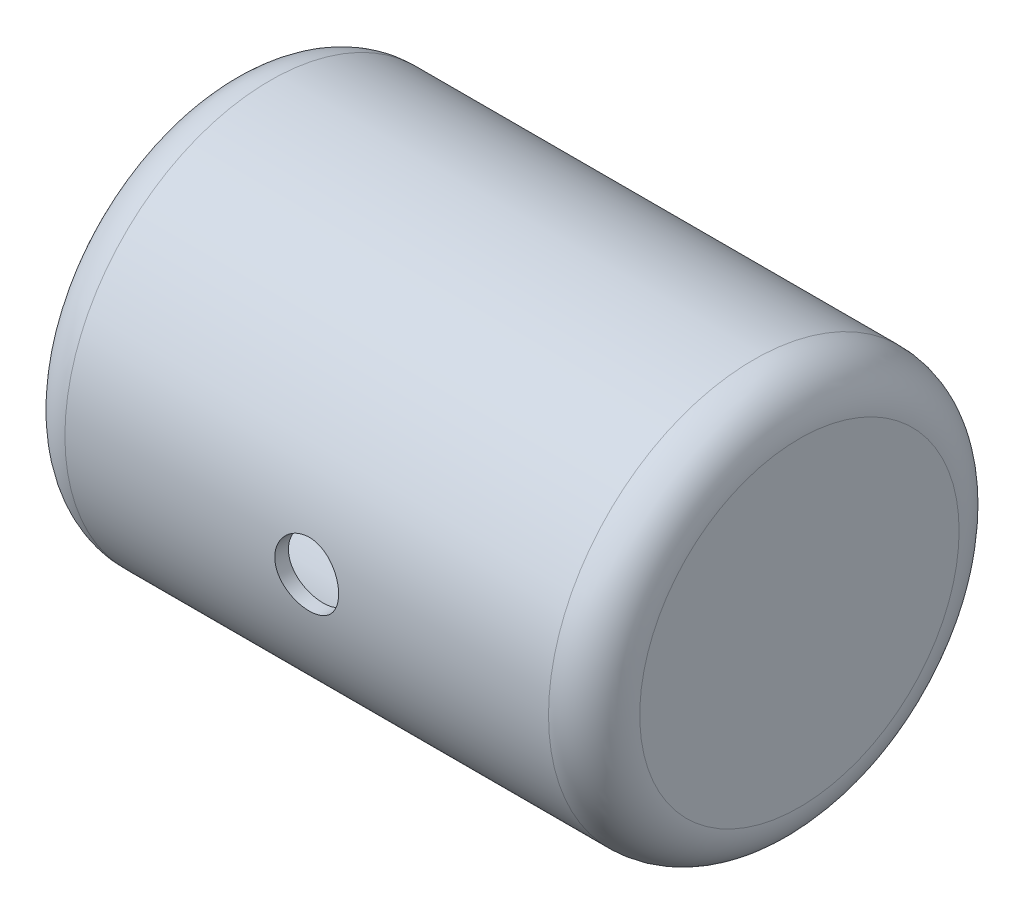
ISO-10303-21;
HEADER;
FILE_DESCRIPTION(('STEP AP214'),'2;1');
FILE_NAME('part.step','',(''),(''),'','','');
FILE_SCHEMA(('AUTOMOTIVE_DESIGN { 1 0 10303 214 1 1 1 1 }'));
ENDSEC;
DATA;
#1=APPLICATION_CONTEXT('core data for automotive mechanical design processes');
#2=APPLICATION_PROTOCOL_DEFINITION('international standard','automotive_design',2000,#1);
#3=PRODUCT_CONTEXT('',#1,'mechanical');
#4=PRODUCT('Part','Part','',(#3));
#5=PRODUCT_RELATED_PRODUCT_CATEGORY('part','',(#4));
#6=PRODUCT_DEFINITION_FORMATION('','',#4);
#7=PRODUCT_DEFINITION_CONTEXT('part definition',#1,'design');
#8=PRODUCT_DEFINITION('design','',#6,#7);
#9=PRODUCT_DEFINITION_SHAPE('','',#8);
#10=(LENGTH_UNIT() NAMED_UNIT(*) SI_UNIT(.MILLI.,.METRE.));
#11=(NAMED_UNIT(*) PLANE_ANGLE_UNIT() SI_UNIT($,.RADIAN.));
#12=(NAMED_UNIT(*) SI_UNIT($,.STERADIAN.) SOLID_ANGLE_UNIT());
#13=UNCERTAINTY_MEASURE_WITH_UNIT(LENGTH_MEASURE(1.E-05),#10,'distance_accuracy_value','');
#14=(GEOMETRIC_REPRESENTATION_CONTEXT(3) GLOBAL_UNCERTAINTY_ASSIGNED_CONTEXT((#13)) GLOBAL_UNIT_ASSIGNED_CONTEXT((#10,
#11,#12)) REPRESENTATION_CONTEXT('',''));
#15=CARTESIAN_POINT('',(0.,0.,0.));
#16=DIRECTION('',(0.,0.,1.));
#17=DIRECTION('',(1.,0.,0.));
#18=AXIS2_PLACEMENT_3D('',#15,#16,#17);
#19=CARTESIAN_POINT('',(60.,0.,0.));
#20=DIRECTION('',(-1.,0.,0.));
#21=DIRECTION('',(0.,0.,1.));
#22=AXIS2_PLACEMENT_3D('',#19,#20,#21);
#23=CYLINDRICAL_SURFACE('',#22,42.);
#24=CARTESIAN_POINT('',(0.,-41.2310562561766,8.));
#25=CARTESIAN_POINT('',(0.222559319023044,-41.2310541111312,8.00000412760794));
#26=CARTESIAN_POINT('',(0.445065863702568,-41.2328616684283,7.99071005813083));
#27=CARTESIAN_POINT('',(0.888540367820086,-41.2400339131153,7.95361477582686));
#28=CARTESIAN_POINT('',(1.10950804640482,-41.2453992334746,7.9258102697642));
#29=CARTESIAN_POINT('',(1.54836509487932,-41.2595357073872,7.85188634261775));
#30=CARTESIAN_POINT('',(1.76625268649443,-41.268308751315,7.80575675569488));
#31=CARTESIAN_POINT('',(2.19736572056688,-41.2890063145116,7.69552477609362));
#32=CARTESIAN_POINT('',(2.41058941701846,-41.3009319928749,7.63141577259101));
#33=CARTESIAN_POINT('',(2.83051656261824,-41.327569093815,7.4858196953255));
#34=CARTESIAN_POINT('',(3.03722832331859,-41.3422767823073,7.40435589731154));
#35=CARTESIAN_POINT('',(3.44308712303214,-41.374072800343,7.22457132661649));
#36=CARTESIAN_POINT('',(3.64223130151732,-41.3911620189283,7.12624425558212));
#37=CARTESIAN_POINT('',(4.03143007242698,-41.4272240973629,6.91351789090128));
#38=CARTESIAN_POINT('',(4.22148918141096,-41.4461960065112,6.79912669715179));
#39=CARTESIAN_POINT('',(4.59144332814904,-41.4855095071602,6.55498205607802));
#40=CARTESIAN_POINT('',(4.77133368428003,-41.5058517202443,6.42522161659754));
#41=CARTESIAN_POINT('',(5.12167450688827,-41.5475745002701,6.14968973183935));
#42=CARTESIAN_POINT('',(5.29199244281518,-41.5689643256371,6.00375114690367));
#43=CARTESIAN_POINT('',(5.61969195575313,-41.6119520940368,5.69817790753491));
#44=CARTESIAN_POINT('',(5.77707919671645,-41.6335499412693,5.53854931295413));
#45=CARTESIAN_POINT('',(6.07800179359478,-41.6763711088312,5.20654513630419));
#46=CARTESIAN_POINT('',(6.22153065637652,-41.6975942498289,5.0341636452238));
#47=CARTESIAN_POINT('',(6.49361366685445,-41.739057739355,4.67794760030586));
#48=CARTESIAN_POINT('',(6.62217306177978,-41.7592984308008,4.4941170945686));
#49=CARTESIAN_POINT('',(6.86444607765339,-41.7983995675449,4.11466373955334));
#50=CARTESIAN_POINT('',(6.9780312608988,-41.817247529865,3.9189575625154));
#51=CARTESIAN_POINT('',(7.18828539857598,-41.8528458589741,3.5184796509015));
#52=CARTESIAN_POINT('',(7.28495463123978,-41.8695962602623,3.31370806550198));
#53=CARTESIAN_POINT('',(7.46064478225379,-41.9005219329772,2.89654941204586));
#54=CARTESIAN_POINT('',(7.53966647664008,-41.914697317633,2.68416267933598));
#55=CARTESIAN_POINT('',(7.6794503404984,-41.9400671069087,2.25329449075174));
#56=CARTESIAN_POINT('',(7.74021311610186,-41.9512616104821,2.03481323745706));
#57=CARTESIAN_POINT('',(7.84239182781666,-41.9702348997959,1.59594843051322));
#58=CARTESIAN_POINT('',(7.88402745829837,-41.978052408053,1.37561769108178));
#59=CARTESIAN_POINT('',(7.9486557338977,-41.9902383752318,0.93222609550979));
#60=CARTESIAN_POINT('',(7.97165529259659,-41.9946081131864,0.709166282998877));
#61=CARTESIAN_POINT('',(7.9988534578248,-41.9997794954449,0.261838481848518));
#62=CARTESIAN_POINT('',(8.00305008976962,-42.000580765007,0.0375703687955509));
#63=CARTESIAN_POINT('',(7.99260295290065,-41.9985913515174,-0.410509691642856));
#64=CARTESIAN_POINT('',(7.97795931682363,-41.9958006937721,-0.634321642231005));
#65=CARTESIAN_POINT('',(7.93026584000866,-41.9867667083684,-1.07692964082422));
#66=CARTESIAN_POINT('',(7.8974600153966,-41.9805691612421,-1.29575297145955));
#67=CARTESIAN_POINT('',(7.81385607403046,-41.9649218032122,-1.72989518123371));
#68=CARTESIAN_POINT('',(7.76305170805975,-41.9554708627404,-1.94521281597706));
#69=CARTESIAN_POINT('',(7.64385178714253,-41.9335789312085,-2.37072563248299));
#70=CARTESIAN_POINT('',(7.57545917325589,-41.9211384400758,-2.58092166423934));
#71=CARTESIAN_POINT('',(7.4215882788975,-41.8936062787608,-2.99479064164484));
#72=CARTESIAN_POINT('',(7.33610940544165,-41.8785145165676,-3.19846336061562));
#73=CARTESIAN_POINT('',(7.14815026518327,-41.8459966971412,-3.59905261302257));
#74=CARTESIAN_POINT('',(7.04557488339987,-41.8285576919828,-3.79592346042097));
#75=CARTESIAN_POINT('',(6.82450652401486,-41.7918893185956,-4.18034394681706));
#76=CARTESIAN_POINT('',(6.70601316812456,-41.7726599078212,-4.36789336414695));
#77=CARTESIAN_POINT('',(6.45392836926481,-41.73293308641,-4.73243293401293));
#78=CARTESIAN_POINT('',(6.32033576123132,-41.7124355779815,-4.90942227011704));
#79=CARTESIAN_POINT('',(6.03897072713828,-41.670730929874,-5.25165755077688));
#80=CARTESIAN_POINT('',(5.89119813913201,-41.6495237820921,-5.41690336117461));
#81=CARTESIAN_POINT('',(5.5800146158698,-41.6066394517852,-5.73707755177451));
#82=CARTESIAN_POINT('',(5.41639295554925,-41.5849601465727,-5.89180091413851));
#83=CARTESIAN_POINT('',(5.07665945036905,-41.5420760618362,-6.18693458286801));
#84=CARTESIAN_POINT('',(4.90054774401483,-41.5208712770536,-6.32734504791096));
#85=CARTESIAN_POINT('',(4.53702277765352,-41.4795367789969,-6.59288183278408));
#86=CARTESIAN_POINT('',(4.34960900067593,-41.4594071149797,-6.71800745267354));
#87=CARTESIAN_POINT('',(3.96477527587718,-41.4208015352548,-6.9520698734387));
#88=CARTESIAN_POINT('',(3.76735563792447,-41.4023255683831,-7.06100717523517));
#89=CARTESIAN_POINT('',(3.36346239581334,-41.3675274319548,-7.26210122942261));
#90=CARTESIAN_POINT('',(3.15697135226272,-41.3512096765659,-7.35422373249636));
#91=CARTESIAN_POINT('',(2.73683978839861,-41.3212585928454,-7.52068770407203));
#92=CARTESIAN_POINT('',(2.52320192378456,-41.307624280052,-7.5950356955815));
#93=CARTESIAN_POINT('',(2.09021639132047,-41.2834383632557,-7.72542028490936));
#94=CARTESIAN_POINT('',(1.87086821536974,-41.2728870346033,-7.78145524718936));
#95=CARTESIAN_POINT('',(1.42808112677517,-41.2551873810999,-7.87475544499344));
#96=CARTESIAN_POINT('',(1.20464227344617,-41.2480390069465,-7.91202095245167));
#97=CARTESIAN_POINT('',(0.758861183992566,-41.237446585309,-7.96704283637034));
#98=CARTESIAN_POINT('',(0.536556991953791,-41.2339460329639,-7.98509689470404));
#99=CARTESIAN_POINT('',(0.091110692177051,-41.2305552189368,-8.00258690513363));
#100=CARTESIAN_POINT('',(-0.132031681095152,-41.2306662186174,-8.00201635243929));
#101=CARTESIAN_POINT('',(-0.577404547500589,-41.2344979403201,-7.9822477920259));
#102=CARTESIAN_POINT('',(-0.799635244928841,-41.2382178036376,-7.96305421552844));
#103=CARTESIAN_POINT('',(-1.24163801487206,-41.2491557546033,-7.90619918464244));
#104=CARTESIAN_POINT('',(-1.46141004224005,-41.2563739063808,-7.86853739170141));
#105=CARTESIAN_POINT('',(-1.89504126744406,-41.2740190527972,-7.7754466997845));
#106=CARTESIAN_POINT('',(-2.10893508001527,-41.2844178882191,-7.72017354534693));
#107=CARTESIAN_POINT('',(-2.53127534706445,-41.3081456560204,-7.5921890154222));
#108=CARTESIAN_POINT('',(-2.73972171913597,-41.321474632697,-7.51947737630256));
#109=CARTESIAN_POINT('',(-3.1497174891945,-41.3506820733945,-7.35716558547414));
#110=CARTESIAN_POINT('',(-3.35126766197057,-41.3665602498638,-7.26756733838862));
#111=CARTESIAN_POINT('',(-3.746208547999,-41.4004269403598,-7.07209205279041));
#112=CARTESIAN_POINT('',(-3.93959653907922,-41.4184161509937,-6.96620963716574));
#113=CARTESIAN_POINT('',(-4.3190778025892,-41.4562222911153,-6.73759657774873));
#114=CARTESIAN_POINT('',(-4.50505894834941,-41.4760581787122,-6.61468293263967));
#115=CARTESIAN_POINT('',(-4.86604424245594,-41.516818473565,-6.35383375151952));
#116=CARTESIAN_POINT('',(-5.04104825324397,-41.5377428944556,-6.21589802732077));
#117=CARTESIAN_POINT('',(-5.37895173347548,-41.5801035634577,-5.92591404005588));
#118=CARTESIAN_POINT('',(-5.54184828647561,-41.601539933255,-5.77386239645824));
#119=CARTESIAN_POINT('',(-5.85435060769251,-41.6443209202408,-5.45674982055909));
#120=CARTESIAN_POINT('',(-6.00396054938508,-41.6656655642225,-5.29169300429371));
#121=CARTESIAN_POINT('',(-6.29093608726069,-41.7079782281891,-4.94722912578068));
#122=CARTESIAN_POINT('',(-6.42810064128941,-41.7289367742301,-4.76765333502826));
#123=CARTESIAN_POINT('',(-6.68681092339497,-41.7695716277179,-4.39744866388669));
#124=CARTESIAN_POINT('',(-6.80835685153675,-41.7892479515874,-4.20681992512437));
#125=CARTESIAN_POINT('',(-7.03495161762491,-41.8267624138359,-3.81582369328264));
#126=CARTESIAN_POINT('',(-7.14000051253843,-41.8446005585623,-3.61545623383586));
#127=CARTESIAN_POINT('',(-7.33281631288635,-41.8779318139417,-3.20638905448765));
#128=CARTESIAN_POINT('',(-7.4205837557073,-41.8934249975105,-2.99768959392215));
#129=CARTESIAN_POINT('',(-7.57776012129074,-41.9215517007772,-2.57453458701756));
#130=CARTESIAN_POINT('',(-7.64726172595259,-41.9341996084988,-2.36011442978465));
#131=CARTESIAN_POINT('',(-7.76793664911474,-41.9563740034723,-1.92610290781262));
#132=CARTESIAN_POINT('',(-7.81911675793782,-41.9659016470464,-1.70651349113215));
#133=CARTESIAN_POINT('',(-7.90278102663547,-41.9815704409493,-1.26365991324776));
#134=CARTESIAN_POINT('',(-7.93526343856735,-41.987711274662,-1.04039541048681));
#135=CARTESIAN_POINT('',(-7.9812614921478,-41.9964286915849,-0.591852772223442));
#136=CARTESIAN_POINT('',(-7.99477736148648,-41.9990053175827,-0.366574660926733));
#137=CARTESIAN_POINT('',(-8.00266935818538,-42.0005083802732,0.0807226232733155));
#138=CARTESIAN_POINT('',(-7.99734799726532,-41.999492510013,0.30273632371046));
#139=CARTESIAN_POINT('',(-7.96827183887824,-41.9939656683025,0.74558769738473));
#140=CARTESIAN_POINT('',(-7.94451062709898,-41.989453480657,0.966424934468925));
#141=CARTESIAN_POINT('',(-7.87874103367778,-41.9770594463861,1.40522151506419));
#142=CARTESIAN_POINT('',(-7.83673639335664,-41.9691782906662,1.62318143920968));
#143=CARTESIAN_POINT('',(-7.73480612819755,-41.9502648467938,2.05473420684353));
#144=CARTESIAN_POINT('',(-7.67488006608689,-41.9392324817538,2.26832694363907));
#145=CARTESIAN_POINT('',(-7.53769613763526,-41.9143451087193,2.68924558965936));
#146=CARTESIAN_POINT('',(-7.46047173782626,-41.9004955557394,2.89658273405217));
#147=CARTESIAN_POINT('',(-7.28919699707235,-41.8703390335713,3.3040037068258));
#148=CARTESIAN_POINT('',(-7.19514634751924,-41.854032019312,3.50408740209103));
#149=CARTESIAN_POINT('',(-6.99091022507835,-41.819405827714,3.89562873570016));
#150=CARTESIAN_POINT('',(-6.88072665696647,-41.8010868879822,4.08708738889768));
#151=CARTESIAN_POINT('',(-6.64495108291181,-41.7629242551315,4.46019531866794));
#152=CARTESIAN_POINT('',(-6.51935401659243,-41.7430800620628,4.64184134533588));
#153=CARTESIAN_POINT('',(-6.25169888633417,-41.7021102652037,4.99663457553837));
#154=CARTESIAN_POINT('',(-6.10942744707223,-41.680970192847,5.16961917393));
#155=CARTESIAN_POINT('',(-5.81091640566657,-41.6382628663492,5.50302822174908));
#156=CARTESIAN_POINT('',(-5.65467667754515,-41.6166956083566,5.66345255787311));
#157=CARTESIAN_POINT('',(-5.32922402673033,-41.5737249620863,5.97071803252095));
#158=CARTESIAN_POINT('',(-5.16000585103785,-41.5523216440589,6.1175536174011));
#159=CARTESIAN_POINT('',(-4.80985558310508,-41.5102941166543,6.39651298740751));
#160=CARTESIAN_POINT('',(-4.62892758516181,-41.4896696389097,6.52864187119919));
#161=CARTESIAN_POINT('',(-4.25466152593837,-41.4495741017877,6.77856855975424));
#162=CARTESIAN_POINT('',(-4.06121754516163,-41.4301166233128,6.89621001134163));
#163=CARTESIAN_POINT('',(-3.6649868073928,-41.3931544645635,7.1147059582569));
#164=CARTESIAN_POINT('',(-3.46220352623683,-41.3756490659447,7.21556663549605));
#165=CARTESIAN_POINT('',(-3.04877336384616,-41.3431082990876,7.39973972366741));
#166=CARTESIAN_POINT('',(-2.8381315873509,-41.3280713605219,7.48306330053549));
#167=CARTESIAN_POINT('',(-2.41044277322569,-41.3009037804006,7.63158082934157));
#168=CARTESIAN_POINT('',(-2.1933970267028,-41.2887725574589,7.69677840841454));
#169=CARTESIAN_POINT('',(-1.65201139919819,-41.2628893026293,7.83460648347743));
#170=CARTESIAN_POINT('',(-1.32479658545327,-41.2510154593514,7.89654753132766));
#171=CARTESIAN_POINT('',(-0.665015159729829,-41.2351006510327,7.97924061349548));
#172=CARTESIAN_POINT('',(-0.332448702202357,-41.2310594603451,7.99999383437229));
#173=CARTESIAN_POINT('',(0.,-41.2310562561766,8.));
#174=B_SPLINE_CURVE_WITH_KNOTS('',3,(#24,#25,#26,#27,#28,#29,#30,#31,#32,#33,#34,#35,#36,#37,
#38,#39,#40,#41,#42,#43,#44,#45,#46,#47,#48,#49,#50,#51,#52,#53,#54,#55,#56,#57,#58,#59,#60,#61,
#62,#63,#64,#65,#66,#67,#68,#69,#70,#71,#72,#73,#74,#75,#76,#77,#78,#79,#80,#81,#82,#83,#84,#85,
#86,#87,#88,#89,#90,#91,#92,#93,#94,#95,#96,#97,#98,#99,#100,#101,#102,#103,#104,#105,#106,#107,
#108,#109,#110,#111,#112,#113,#114,#115,#116,#117,#118,#119,#120,#121,#122,#123,#124,#125,#126,
#127,#128,#129,#130,#131,#132,#133,#134,#135,#136,#137,#138,#139,#140,#141,#142,#143,#144,#145,
#146,#147,#148,#149,#150,#151,#152,#153,#154,#155,#156,#157,#158,#159,#160,#161,#162,#163,#164,
#165,#166,#167,#168,#169,#170,#171,#172,#173),.UNSPECIFIED.,.T.,.F.,(4,2,2,2,2,2,2,2,2,2,2,2,2,
2,2,2,2,2,2,2,2,2,2,2,2,2,2,2,2,2,2,2,2,2,2,2,2,2,2,2,2,2,2,2,2,2,2,2,2,2,2,2,2,2,2,2,2,2,2,2,2,
2,2,2,2,2,2,2,2,2,2,2,2,2,4),(0.,0.667385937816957,1.33489064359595,2.00276616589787,
2.67088758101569,3.33811850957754,4.00559919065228,4.67274451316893,5.34019452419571,
6.0153291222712,6.69016640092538,7.36531834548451,8.04023291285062,8.72060440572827,
9.40096470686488,10.0812950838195,10.7616028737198,11.4338882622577,12.1059241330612,
12.778030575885,13.4501322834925,14.1134158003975,14.7769298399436,15.440333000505,
16.1037591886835,16.7710076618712,17.4382719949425,18.1055878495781,18.7729113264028,
19.4508107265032,20.1287026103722,20.8066255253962,21.4845274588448,22.1637951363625,
22.8428131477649,23.5218917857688,24.2009605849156,24.8693467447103,25.5379663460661,
26.2064268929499,26.8748996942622,27.5376177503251,28.2003458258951,28.8629991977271,
29.5258718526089,30.1965172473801,30.8671710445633,31.5379858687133,32.208589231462,
32.8885931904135,33.5685884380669,34.2485813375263,34.9285530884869,35.6050049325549,
36.281205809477,36.9574698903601,37.633725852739,38.2991712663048,38.9648482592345,
39.6303888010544,40.295945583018,40.9602256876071,41.624517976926,42.2887318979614,
42.9531644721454,43.6272882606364,44.3014181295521,44.9758223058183,45.64999193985,
46.3308964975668,47.0115496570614,47.6917681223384,48.3718503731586,49.3687889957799,
50.365698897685),.UNSPECIFIED.);
#175=CARTESIAN_POINT('',(0.,-41.2310562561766,8.));
#176=VERTEX_POINT('',#175);
#177=EDGE_CURVE('E59',#176,#176,#174,.T.);
#178=ORIENTED_EDGE('',*,*,#177,.F.);
#179=EDGE_LOOP('',(#178));
#180=FACE_BOUND('',#179,.T.);
#181=CARTESIAN_POINT('',(-53.,0.,0.));
#182=DIRECTION('',(1.,0.,0.));
#183=DIRECTION('',(0.,0.,-1.));
#184=AXIS2_PLACEMENT_3D('',#181,#182,#183);
#185=CIRCLE('',#184,42.);
#186=CARTESIAN_POINT('',(-53.,0.,-42.));
#187=VERTEX_POINT('',#186);
#188=EDGE_CURVE('E121',#187,#187,#185,.F.);
#189=ORIENTED_EDGE('',*,*,#188,.T.);
#190=EDGE_LOOP('',(#189));
#191=FACE_BOUND('',#190,.T.);
#192=CARTESIAN_POINT('',(53.,0.,0.));
#193=DIRECTION('',(1.,0.,0.));
#194=DIRECTION('',(0.,0.,-1.));
#195=AXIS2_PLACEMENT_3D('',#192,#193,#194);
#196=CIRCLE('',#195,42.);
#197=CARTESIAN_POINT('',(53.,0.,-42.));
#198=VERTEX_POINT('',#197);
#199=EDGE_CURVE('E49',#198,#198,#196,.T.);
#200=ORIENTED_EDGE('',*,*,#199,.T.);
#201=EDGE_LOOP('',(#200));
#202=FACE_BOUND('',#201,.T.);
#203=CARTESIAN_POINT('',(7.,0.,42.));
#204=CARTESIAN_POINT('',(7.00000300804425,0.195214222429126,42.0000013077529));
#205=CARTESIAN_POINT('',(6.9918313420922,0.390387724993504,41.9986364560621));
#206=CARTESIAN_POINT('',(6.95921214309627,0.779392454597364,41.9932179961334));
#207=CARTESIAN_POINT('',(6.9347613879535,0.973223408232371,41.9891638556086));
#208=CARTESIAN_POINT('',(6.86974566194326,1.35821072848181,41.9784752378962));
#209=CARTESIAN_POINT('',(6.82917052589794,1.54936532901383,41.9718391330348));
#210=CARTESIAN_POINT('',(6.73219952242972,1.92759345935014,41.9561702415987));
#211=CARTESIAN_POINT('',(6.67579784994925,2.11466546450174,41.9471365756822));
#212=CARTESIAN_POINT('',(6.54768099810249,2.48311739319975,41.9269380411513));
#213=CARTESIAN_POINT('',(6.47598424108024,2.66450386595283,41.9157757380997));
#214=CARTESIAN_POINT('',(6.31773552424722,3.02062890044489,41.8916181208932));
#215=CARTESIAN_POINT('',(6.23117808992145,3.19536498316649,41.8786221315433));
#216=CARTESIAN_POINT('',(6.04389644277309,3.53683712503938,41.8511662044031));
#217=CARTESIAN_POINT('',(5.94317927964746,3.70357711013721,41.8367069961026));
#218=CARTESIAN_POINT('',(5.72821574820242,4.02808106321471,41.8067115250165));
#219=CARTESIAN_POINT('',(5.61396434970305,4.18584166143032,41.7911748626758));
#220=CARTESIAN_POINT('',(5.37176366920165,4.49250970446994,41.7593261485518));
#221=CARTESIAN_POINT('',(5.24370984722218,4.64133404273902,41.7430087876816));
#222=CARTESIAN_POINT('',(4.97552174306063,4.92774667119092,41.7101678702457));
#223=CARTESIAN_POINT('',(4.83538300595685,5.065330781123,41.6936442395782));
#224=CARTESIAN_POINT('',(4.54407181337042,5.32821660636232,41.6608647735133));
#225=CARTESIAN_POINT('',(4.39290272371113,5.45352204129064,41.6446088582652));
#226=CARTESIAN_POINT('',(4.08046898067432,5.69107180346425,41.612811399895));
#227=CARTESIAN_POINT('',(3.91920062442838,5.80331129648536,41.5972701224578));
#228=CARTESIAN_POINT('',(3.58672998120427,6.01451452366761,41.5672595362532));
#229=CARTESIAN_POINT('',(3.41547400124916,6.11339475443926,41.5527972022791));
#230=CARTESIAN_POINT('',(3.06510876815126,6.29636136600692,41.5254668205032));
#231=CARTESIAN_POINT('',(2.8859994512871,6.38044762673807,41.5125987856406));
#232=CARTESIAN_POINT('',(2.52120533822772,6.53319385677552,41.4888341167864));
#233=CARTESIAN_POINT('',(2.33552097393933,6.60185483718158,41.4779373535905));
#234=CARTESIAN_POINT('',(1.95889112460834,6.72323520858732,41.4584356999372));
#235=CARTESIAN_POINT('',(1.76794557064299,6.77595439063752,41.4498308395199));
#236=CARTESIAN_POINT('',(1.3839912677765,6.86462102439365,41.4352383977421));
#237=CARTESIAN_POINT('',(1.19101870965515,6.90072126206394,41.4292270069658));
#238=CARTESIAN_POINT('',(0.802595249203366,6.95660544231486,41.4198797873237));
#239=CARTESIAN_POINT('',(0.607143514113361,6.97638374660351,41.4165448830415));
#240=CARTESIAN_POINT('',(0.215311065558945,6.99943710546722,41.4126554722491));
#241=CARTESIAN_POINT('',(0.0189307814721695,7.00271915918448,41.4120997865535));
#242=CARTESIAN_POINT('',(-0.373420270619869,6.99279216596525,41.4137757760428));
#243=CARTESIAN_POINT('',(-0.569390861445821,6.97957705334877,41.4160084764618));
#244=CARTESIAN_POINT('',(-1.15036477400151,6.91570731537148,41.4267459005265));
#245=CARTESIAN_POINT('',(-1.53295094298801,6.84108594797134,41.4392476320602));
#246=CARTESIAN_POINT('',(-2.27988219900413,6.62970851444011,41.4735842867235));
#247=CARTESIAN_POINT('',(-2.64422665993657,6.49295031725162,41.4954195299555));
#248=CARTESIAN_POINT('',(-3.34662383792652,6.16049636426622,41.5460778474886));
#249=CARTESIAN_POINT('',(-3.68454181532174,5.96452057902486,41.5749339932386));
#250=CARTESIAN_POINT('',(-4.32293684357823,5.51939362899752,41.6363616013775));
#251=CARTESIAN_POINT('',(-4.62341086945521,5.27023817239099,41.6689333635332));
#252=CARTESIAN_POINT('',(-5.18231180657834,4.72215019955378,41.7346168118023));
#253=CARTESIAN_POINT('',(-5.44017152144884,4.42263910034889,41.7677301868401));
#254=CARTESIAN_POINT('',(-5.90205806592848,3.78429869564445,41.8303928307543));
#255=CARTESIAN_POINT('',(-6.10608454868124,3.44546913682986,41.8599420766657));
#256=CARTESIAN_POINT('',(-6.45456614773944,2.73757656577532,41.9121890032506));
#257=CARTESIAN_POINT('',(-6.59897115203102,2.36848843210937,41.9348809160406));
#258=CARTESIAN_POINT('',(-6.8235838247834,1.61083536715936,41.9708100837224));
#259=CARTESIAN_POINT('',(-6.90379686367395,1.22227206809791,41.9840481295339));
#260=CARTESIAN_POINT('',(-6.99697980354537,0.441587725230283,41.9994716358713));
#261=CARTESIAN_POINT('',(-7.01072842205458,0.049562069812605,42.0017850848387));
#262=CARTESIAN_POINT('',(-6.97266821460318,-0.731191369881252,41.9954492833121));
#263=CARTESIAN_POINT('',(-6.92086191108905,-1.11991928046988,41.9868004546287));
#264=CARTESIAN_POINT('',(-6.75381050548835,-1.88063727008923,41.9595911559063));
#265=CARTESIAN_POINT('',(-6.63895092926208,-2.25271435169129,41.9410909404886));
#266=CARTESIAN_POINT('',(-6.3494630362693,-2.97233135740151,41.8962449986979));
#267=CARTESIAN_POINT('',(-6.17483136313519,-3.31986990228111,41.869898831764));
#268=CARTESIAN_POINT('',(-5.76897802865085,-3.98392563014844,41.8119664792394));
#269=CARTESIAN_POINT('',(-5.5372699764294,-4.30014157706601,41.7803360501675));
#270=CARTESIAN_POINT('',(-5.02449110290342,-4.88948316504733,41.7154770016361));
#271=CARTESIAN_POINT('',(-4.74341669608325,-5.16260567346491,41.6822482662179));
#272=CARTESIAN_POINT('',(-4.13646351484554,-5.66087553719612,41.6175252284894));
#273=CARTESIAN_POINT('',(-3.81015077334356,-5.88549660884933,41.5860524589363));
#274=CARTESIAN_POINT('',(-3.12374925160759,-6.27678239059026,41.5288016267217));
#275=CARTESIAN_POINT('',(-2.7636615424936,-6.44344893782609,41.5030233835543));
#276=CARTESIAN_POINT('',(-2.20714258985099,-6.64586236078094,41.4709177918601));
#277=CARTESIAN_POINT('',(-2.0192086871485,-6.70534693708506,41.4613193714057));
#278=CARTESIAN_POINT('',(-1.63891092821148,-6.80828177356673,41.4445419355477));
#279=CARTESIAN_POINT('',(-1.44654869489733,-6.85173781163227,41.4373620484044));
#280=CARTESIAN_POINT('',(-1.05875565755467,-6.92227576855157,41.425636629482));
#281=CARTESIAN_POINT('',(-0.863324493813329,-6.94935575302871,41.4210914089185));
#282=CARTESIAN_POINT('',(-0.470831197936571,-6.98692885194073,41.4147702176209));
#283=CARTESIAN_POINT('',(-0.273769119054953,-6.99742250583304,41.4129941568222));
#284=CARTESIAN_POINT('',(0.118080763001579,-7.00171200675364,41.4122690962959));
#285=CARTESIAN_POINT('',(0.312866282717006,-6.99571444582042,41.4132851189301));
#286=CARTESIAN_POINT('',(0.701223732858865,-6.96750944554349,41.4180397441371));
#287=CARTESIAN_POINT('',(0.894795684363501,-6.94530228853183,41.42177829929));
#288=CARTESIAN_POINT('',(1.27938275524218,-6.88484406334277,41.4318700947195));
#289=CARTESIAN_POINT('',(1.47039741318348,-6.84659013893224,41.4382238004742));
#290=CARTESIAN_POINT('',(1.8484161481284,-6.75434646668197,41.4533591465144));
#291=CARTESIAN_POINT('',(2.03542164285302,-6.7003623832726,41.4621399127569));
#292=CARTESIAN_POINT('',(2.40403574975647,-6.57710793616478,41.4818700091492));
#293=CARTESIAN_POINT('',(2.58564864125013,-6.50785008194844,41.4928175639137));
#294=CARTESIAN_POINT('',(2.9423222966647,-6.3545578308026,41.5165702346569));
#295=CARTESIAN_POINT('',(3.11738538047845,-6.27052872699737,41.5293746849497));
#296=CARTESIAN_POINT('',(3.45990600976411,-6.08824297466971,41.5564891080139));
#297=CARTESIAN_POINT('',(3.62736053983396,-5.98998074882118,41.5707996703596));
#298=CARTESIAN_POINT('',(3.95340614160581,-5.77998002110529,41.600517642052));
#299=CARTESIAN_POINT('',(4.11200030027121,-5.66824625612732,41.6159246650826));
#300=CARTESIAN_POINT('',(4.42121217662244,-5.43059559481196,41.6476070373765));
#301=CARTESIAN_POINT('',(4.57170852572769,-5.30452185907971,41.6638907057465));
#302=CARTESIAN_POINT('',(4.86151875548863,-5.04024604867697,41.6966861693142));
#303=CARTESIAN_POINT('',(5.00083661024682,-4.90204832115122,41.7131978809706));
#304=CARTESIAN_POINT('',(5.26747470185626,-4.61434715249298,41.7460030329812));
#305=CARTESIAN_POINT('',(5.39478773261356,-4.46483701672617,41.7622963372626));
#306=CARTESIAN_POINT('',(5.63639400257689,-4.15566352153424,41.7941933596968));
#307=CARTESIAN_POINT('',(5.7506920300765,-3.99600393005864,41.8097973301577));
#308=CARTESIAN_POINT('',(5.9663030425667,-3.66637354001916,41.8399962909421));
#309=CARTESIAN_POINT('',(6.06751515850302,-3.49633598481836,41.8545830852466));
#310=CARTESIAN_POINT('',(6.25519544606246,-3.14827110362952,41.8822021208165));
#311=CARTESIAN_POINT('',(6.34166904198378,-2.97024674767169,41.8952349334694));
#312=CARTESIAN_POINT('',(6.4992209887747,-2.60752550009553,41.9193727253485));
#313=CARTESIAN_POINT('',(6.57031002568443,-2.42283334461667,41.9304790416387));
#314=CARTESIAN_POINT('',(6.69661274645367,-2.04804578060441,41.9504558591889));
#315=CARTESIAN_POINT('',(6.75182983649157,-1.85795154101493,41.9593268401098));
#316=CARTESIAN_POINT('',(6.86556962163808,-1.39368899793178,41.9777516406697));
#317=CARTESIAN_POINT('',(6.91592111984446,-1.11742664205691,41.9860558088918));
#318=CARTESIAN_POINT('',(6.98313386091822,-0.560748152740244,41.9971790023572));
#319=CARTESIAN_POINT('',(6.99999568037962,-0.280332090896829,41.999998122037));
#320=CARTESIAN_POINT('',(7.,0.,42.));
#321=B_SPLINE_CURVE_WITH_KNOTS('',3,(#203,#204,#205,#206,#207,#208,#209,#210,#211,#212,#213,
#214,#215,#216,#217,#218,#219,#220,#221,#222,#223,#224,#225,#226,#227,#228,#229,#230,#231,#232,
#233,#234,#235,#236,#237,#238,#239,#240,#241,#242,#243,#244,#245,#246,#247,#248,#249,#250,#251,
#252,#253,#254,#255,#256,#257,#258,#259,#260,#261,#262,#263,#264,#265,#266,#267,#268,#269,#270,
#271,#272,#273,#274,#275,#276,#277,#278,#279,#280,#281,#282,#283,#284,#285,#286,#287,#288,#289,
#290,#291,#292,#293,#294,#295,#296,#297,#298,#299,#300,#301,#302,#303,#304,#305,#306,#307,#308,
#309,#310,#311,#312,#313,#314,#315,#316,#317,#318,#319,#320),.UNSPECIFIED.,.T.,.F.,(4,2,2,2,2,2,
2,2,2,2,2,2,2,2,2,2,2,2,2,2,2,2,2,2,2,2,2,2,2,2,2,2,2,2,2,2,2,2,2,2,2,2,2,2,2,2,2,2,2,2,2,2,2,2,
2,2,2,2,4),(0.,0.585396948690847,1.17090979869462,1.7567923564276,2.3428900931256,
2.92828584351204,3.51389771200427,4.09921904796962,4.68475861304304,5.27509463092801,
5.86564920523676,6.45602432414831,7.0466171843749,7.64074585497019,8.23487934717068,
8.82897388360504,9.4230762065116,10.0116018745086,10.600330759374,11.1888098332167,
11.7775053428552,12.9414854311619,14.1055054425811,15.275118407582,16.4448258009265,
17.6290283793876,18.8132385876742,19.9984421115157,21.1835464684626,22.3547315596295,
23.5258715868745,24.6899294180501,25.8540526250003,27.0284619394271,28.2029565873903,
29.3896178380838,30.5762414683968,31.1677241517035,31.758993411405,32.3503324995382,
32.9416523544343,33.5255983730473,34.1095342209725,34.6935740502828,35.2774038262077,
35.8607571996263,36.4439019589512,37.0272758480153,37.6104452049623,38.2007514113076,
38.7908468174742,39.3812942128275,39.9715236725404,40.5660612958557,41.1603796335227,
41.754283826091,42.3480604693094,43.1887183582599,44.0293617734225),.UNSPECIFIED.);
#322=CARTESIAN_POINT('',(7.,0.,42.));
#323=VERTEX_POINT('',#322);
#324=EDGE_CURVE('E52',#323,#323,#321,.T.);
#325=ORIENTED_EDGE('',*,*,#324,.T.);
#326=EDGE_LOOP('',(#325));
#327=FACE_BOUND('',#326,.T.);
#328=ADVANCED_FACE('F32',(#180,#191,#202,#327),#23,.F.);
#329=CARTESIAN_POINT('',(60.,0.,0.));
#330=DIRECTION('',(1.,0.,0.));
#331=DIRECTION('',(0.,0.,-1.));
#332=AXIS2_PLACEMENT_3D('',#329,#330,#331);
#333=PLANE('',#332);
#334=CARTESIAN_POINT('',(60.,0.,0.));
#335=DIRECTION('',(1.,0.,0.));
#336=DIRECTION('',(0.,0.,-1.));
#337=AXIS2_PLACEMENT_3D('',#334,#335,#336);
#338=CIRCLE('',#337,35.);
#339=CARTESIAN_POINT('',(60.,0.,-35.));
#340=VERTEX_POINT('',#339);
#341=EDGE_CURVE('E44',#340,#340,#338,.F.);
#342=ORIENTED_EDGE('',*,*,#341,.T.);
#343=EDGE_LOOP('',(#342));
#344=FACE_BOUND('',#343,.T.);
#345=ADVANCED_FACE('F106',(#344),#333,.F.);
#346=CARTESIAN_POINT('',(-60.,0.,0.));
#347=DIRECTION('',(1.,0.,0.));
#348=DIRECTION('',(0.,0.,-1.));
#349=AXIS2_PLACEMENT_3D('',#346,#347,#348);
#350=PLANE('',#349);
#351=CARTESIAN_POINT('',(-60.,0.,0.));
#352=DIRECTION('',(1.,0.,0.));
#353=DIRECTION('',(0.,0.,-1.));
#354=AXIS2_PLACEMENT_3D('',#351,#352,#353);
#355=CIRCLE('',#354,35.);
#356=CARTESIAN_POINT('',(-60.,0.,-35.));
#357=VERTEX_POINT('',#356);
#358=EDGE_CURVE('E10',#357,#357,#355,.T.);
#359=ORIENTED_EDGE('',*,*,#358,.T.);
#360=EDGE_LOOP('',(#359));
#361=FACE_BOUND('',#360,.T.);
#362=ADVANCED_FACE('F71',(#361),#350,.T.);
#363=CARTESIAN_POINT('',(53.,0.,0.));
#364=DIRECTION('',(1.,0.,0.));
#365=DIRECTION('',(0.,0.,-1.));
#366=AXIS2_PLACEMENT_3D('',#363,#364,#365);
#367=TOROIDAL_SURFACE('',#366,35.,7.);
#368=ORIENTED_EDGE('',*,*,#341,.F.);
#369=EDGE_LOOP('',(#368));
#370=FACE_BOUND('',#369,.T.);
#371=ORIENTED_EDGE('',*,*,#199,.F.);
#372=EDGE_LOOP('',(#371));
#373=FACE_BOUND('',#372,.T.);
#374=ADVANCED_FACE('F98',(#370,#373),#367,.F.);
#375=CARTESIAN_POINT('',(-53.,0.,0.));
#376=DIRECTION('',(1.,0.,0.));
#377=DIRECTION('',(0.,0.,-1.));
#378=AXIS2_PLACEMENT_3D('',#375,#376,#377);
#379=TOROIDAL_SURFACE('',#378,35.,7.);
#380=ORIENTED_EDGE('',*,*,#188,.F.);
#381=EDGE_LOOP('',(#380));
#382=FACE_BOUND('',#381,.T.);
#383=ORIENTED_EDGE('',*,*,#358,.F.);
#384=EDGE_LOOP('',(#383));
#385=FACE_BOUND('',#384,.T.);
#386=ADVANCED_FACE('F34',(#382,#385),#379,.F.);
#387=CARTESIAN_POINT('',(0.,0.,60.));
#388=DIRECTION('',(0.,0.,-1.));
#389=DIRECTION('',(-1.,0.,0.));
#390=AXIS2_PLACEMENT_3D('',#387,#388,#389);
#391=CYLINDRICAL_SURFACE('',#390,7.);
#392=CARTESIAN_POINT('',(-7.,0.,45.));
#393=CARTESIAN_POINT('',(-7.00000277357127,0.195399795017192,45.0000011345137));
#394=CARTESIAN_POINT('',(-6.99181568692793,0.39076115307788,44.9987248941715));
#395=CARTESIAN_POINT('',(-6.9591335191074,0.780142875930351,44.9936580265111));
#396=CARTESIAN_POINT('',(-6.93463507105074,0.974162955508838,44.9898668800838));
#397=CARTESIAN_POINT('',(-6.86948924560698,1.35953622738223,44.979871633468));
#398=CARTESIAN_POINT('',(-6.82883113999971,1.55088756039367,44.9736659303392));
#399=CARTESIAN_POINT('',(-6.73165727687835,1.92950809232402,44.9590135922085));
#400=CARTESIAN_POINT('',(-6.67513570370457,2.11677576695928,44.9505661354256));
#401=CARTESIAN_POINT('',(-6.54673749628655,2.48562242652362,44.931678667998));
#402=CARTESIAN_POINT('',(-6.47487865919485,2.66720772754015,44.9212409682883));
#403=CARTESIAN_POINT('',(-6.31626440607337,3.02372006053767,44.8986529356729));
#404=CARTESIAN_POINT('',(-6.2295035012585,3.19864461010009,44.8865019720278));
#405=CARTESIAN_POINT('',(-6.04177546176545,3.54047347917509,44.8608338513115));
#406=CARTESIAN_POINT('',(-5.94081561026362,3.7073818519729,44.8473173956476));
#407=CARTESIAN_POINT('',(-5.72532842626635,4.03219716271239,44.8192812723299));
#408=CARTESIAN_POINT('',(-5.610796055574,4.19010072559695,44.8047612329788));
#409=CARTESIAN_POINT('',(-5.36812619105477,4.49685893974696,44.7750173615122));
#410=CARTESIAN_POINT('',(-5.23989755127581,4.64564107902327,44.7597892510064));
#411=CARTESIAN_POINT('',(-4.97135695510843,4.93195159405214,44.729147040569));
#412=CARTESIAN_POINT('',(-4.83104054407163,5.06947578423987,44.7137328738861));
#413=CARTESIAN_POINT('',(-4.53937754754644,5.33221950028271,44.6831615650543));
#414=CARTESIAN_POINT('',(-4.38803437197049,5.45744280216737,44.6680043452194));
#415=CARTESIAN_POINT('',(-4.07526189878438,5.69480433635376,44.6383637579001));
#416=CARTESIAN_POINT('',(-3.91382890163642,5.80693772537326,44.6238806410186));
#417=CARTESIAN_POINT('',(-3.58118362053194,6.01781547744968,44.5959333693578));
#418=CARTESIAN_POINT('',(-3.40992527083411,6.11648794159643,44.5824748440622));
#419=CARTESIAN_POINT('',(-3.05958964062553,6.2990417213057,44.5570485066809));
#420=CARTESIAN_POINT('',(-2.88051228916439,6.38292290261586,44.5450807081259));
#421=CARTESIAN_POINT('',(-2.5158166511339,6.53526713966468,44.522985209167));
#422=CARTESIAN_POINT('',(-2.33019875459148,6.6037311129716,44.5128573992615));
#423=CARTESIAN_POINT('',(-1.95373590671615,6.72473105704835,44.4947383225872));
#424=CARTESIAN_POINT('',(-1.76289087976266,6.77726679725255,44.4867470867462));
#425=CARTESIAN_POINT('',(-1.37894274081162,6.86563920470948,44.473193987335));
#426=CARTESIAN_POINT('',(-1.1858711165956,6.90160968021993,44.4676126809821));
#427=CARTESIAN_POINT('',(-0.797268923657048,6.95721983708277,44.4589460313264));
#428=CARTESIAN_POINT('',(-0.601737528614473,6.97685387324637,44.455861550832));
#429=CARTESIAN_POINT('',(-0.209760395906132,6.99960745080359,44.4522850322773));
#430=CARTESIAN_POINT('',(-0.0133150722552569,7.002733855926,44.4517919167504));
#431=CARTESIAN_POINT('',(0.379153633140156,6.99248540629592,44.4534038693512));
#432=CARTESIAN_POINT('',(0.575176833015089,6.97910447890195,44.4555098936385));
#433=CARTESIAN_POINT('',(1.15683026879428,6.91466644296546,44.4656013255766));
#434=CARTESIAN_POINT('',(1.54002212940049,6.83953815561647,44.4773258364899));
#435=CARTESIAN_POINT('',(2.28808063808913,6.62692497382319,44.5094954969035));
#436=CARTESIAN_POINT('',(2.6529467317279,6.48943819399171,44.5299409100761));
#437=CARTESIAN_POINT('',(3.35604155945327,6.15540508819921,44.5773423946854));
#438=CARTESIAN_POINT('',(3.69415157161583,5.95861234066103,44.6043255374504));
#439=CARTESIAN_POINT('',(4.33275709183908,5.51172929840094,44.6617445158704));
#440=CARTESIAN_POINT('',(4.63324994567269,5.26163524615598,44.6921805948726));
#441=CARTESIAN_POINT('',(5.19150283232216,4.71204260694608,44.7534775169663));
#442=CARTESIAN_POINT('',(5.44876781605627,4.41204097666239,44.7843394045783));
#443=CARTESIAN_POINT('',(5.90937489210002,3.77285940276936,44.8427067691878));
#444=CARTESIAN_POINT('',(6.11271671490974,3.43367926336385,44.87021222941));
#445=CARTESIAN_POINT('',(6.45973852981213,2.72532789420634,44.9187995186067));
#446=CARTESIAN_POINT('',(6.60337854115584,2.35613676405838,44.9398770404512));
#447=CARTESIAN_POINT('',(6.82647917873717,1.59847088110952,44.9731980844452));
#448=CARTESIAN_POINT('',(6.90594447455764,1.2099975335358,44.9854422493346));
#449=CARTESIAN_POINT('',(6.99777761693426,0.429065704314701,44.9996314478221));
#450=CARTESIAN_POINT('',(7.01082579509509,0.0366890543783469,45.0016809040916));
#451=CARTESIAN_POINT('',(6.97126256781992,-0.744647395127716,44.9955345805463));
#452=CARTESIAN_POINT('',(6.91865335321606,-1.13360730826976,44.9873391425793));
#453=CARTESIAN_POINT('',(6.74983488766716,-1.89499520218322,44.96168847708));
#454=CARTESIAN_POINT('',(6.63395881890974,-2.2674988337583,44.9442817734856));
#455=CARTESIAN_POINT('',(6.34224715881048,-2.98779168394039,44.9021534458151));
#456=CARTESIAN_POINT('',(6.16640856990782,-3.33557966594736,44.8774314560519));
#457=CARTESIAN_POINT('',(5.75818453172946,-3.99954737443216,44.8231589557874));
#458=CARTESIAN_POINT('',(5.52536967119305,-4.31546005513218,44.7935723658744));
#459=CARTESIAN_POINT('',(5.01037818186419,-4.90397686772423,44.7329710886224));
#460=CARTESIAN_POINT('',(4.72819845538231,-5.17657827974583,44.7019563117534));
#461=CARTESIAN_POINT('',(4.11952326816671,-5.6732066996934,44.6416622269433));
#462=CARTESIAN_POINT('',(3.79265320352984,-5.89677633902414,44.6124009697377));
#463=CARTESIAN_POINT('',(3.1053811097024,-6.28588029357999,44.5592474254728));
#464=CARTESIAN_POINT('',(2.74498003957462,-6.45141626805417,44.5353549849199));
#465=CARTESIAN_POINT('',(2.18811517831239,-6.65215045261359,44.5056548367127));
#466=CARTESIAN_POINT('',(2.00004679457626,-6.71108611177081,44.4967856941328));
#467=CARTESIAN_POINT('',(1.61954122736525,-6.8129141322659,44.4813094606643));
#468=CARTESIAN_POINT('',(1.42710563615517,-6.8558122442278,44.474701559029));
#469=CARTESIAN_POINT('',(1.03922329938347,-6.92523349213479,44.4639445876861));
#470=CARTESIAN_POINT('',(0.843776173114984,-6.95175454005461,44.4597958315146));
#471=CARTESIAN_POINT('',(0.451305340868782,-6.98821546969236,44.454079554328));
#472=CARTESIAN_POINT('',(0.254281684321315,-6.99815586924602,44.4525119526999));
#473=CARTESIAN_POINT('',(-0.137768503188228,-7.00135944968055,44.4520074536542));
#474=CARTESIAN_POINT('',(-0.332793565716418,-6.99480199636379,44.4530422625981));
#475=CARTESIAN_POINT('',(-0.721583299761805,-6.96543759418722,44.4576528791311));
#476=CARTESIAN_POINT('',(-0.915347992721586,-6.94263092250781,44.4612286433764));
#477=CARTESIAN_POINT('',(-1.3002738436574,-6.88093663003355,44.4708183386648));
#478=CARTESIAN_POINT('',(-1.49143452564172,-6.84204610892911,44.4768327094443));
#479=CARTESIAN_POINT('',(-1.86969637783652,-6.74849468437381,44.4911233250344));
#480=CARTESIAN_POINT('',(-2.05679898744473,-6.69383947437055,44.4993987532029));
#481=CARTESIAN_POINT('',(-2.42560858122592,-6.56919269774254,44.5179702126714));
#482=CARTESIAN_POINT('',(-2.60731837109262,-6.49920927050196,44.5282651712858));
#483=CARTESIAN_POINT('',(-2.96412542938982,-6.3444278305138,44.5505818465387));
#484=CARTESIAN_POINT('',(-3.13922504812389,-6.25963514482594,44.5626029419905));
#485=CARTESIAN_POINT('',(-3.48175044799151,-6.07578878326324,44.5880410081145));
#486=CARTESIAN_POINT('',(-3.6491732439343,-5.97672962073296,44.6014585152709));
#487=CARTESIAN_POINT('',(-3.97508026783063,-5.7651083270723,44.6293054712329));
#488=CARTESIAN_POINT('',(-4.13356763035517,-5.65255097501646,44.6437345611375));
#489=CARTESIAN_POINT('',(-4.44224777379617,-5.41340557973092,44.6733668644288));
#490=CARTESIAN_POINT('',(-4.59233345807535,-5.28668009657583,44.6885767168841));
#491=CARTESIAN_POINT('',(-4.88126545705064,-5.0211287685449,44.7191918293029));
#492=CARTESIAN_POINT('',(-5.02011578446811,-4.8823072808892,44.7345970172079));
#493=CARTESIAN_POINT('',(-5.28576023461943,-4.5933942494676,44.7651855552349));
#494=CARTESIAN_POINT('',(-5.41254709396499,-4.4432960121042,44.7803687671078));
#495=CARTESIAN_POINT('',(-5.65304274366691,-4.13299231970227,44.8100731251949));
#496=CARTESIAN_POINT('',(-5.76675634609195,-3.97279061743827,44.8245945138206));
#497=CARTESIAN_POINT('',(-5.98103499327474,-3.64228654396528,44.8526634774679));
#498=CARTESIAN_POINT('',(-6.08151216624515,-3.47192660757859,44.8662042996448));
#499=CARTESIAN_POINT('',(-6.26769977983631,-3.12329623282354,44.8918206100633));
#500=CARTESIAN_POINT('',(-6.3534156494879,-2.94502873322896,44.9038966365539));
#501=CARTESIAN_POINT('',(-6.50943617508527,-2.58190920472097,44.9262372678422));
#502=CARTESIAN_POINT('',(-6.5797519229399,-2.39706202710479,44.9365031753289));
#503=CARTESIAN_POINT('',(-6.70450431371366,-2.02204831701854,44.9549394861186));
#504=CARTESIAN_POINT('',(-6.75894446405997,-1.83188296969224,44.963110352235));
#505=CARTESIAN_POINT('',(-6.86982424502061,-1.3716640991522,44.9798880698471));
#506=CARTESIAN_POINT('',(-6.91858452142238,-1.09968266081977,44.9873959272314));
#507=CARTESIAN_POINT('',(-6.98367021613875,-0.551775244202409,44.9974510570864));
#508=CARTESIAN_POINT('',(-6.99999608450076,-0.275849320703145,44.9999983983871));
#509=CARTESIAN_POINT('',(-7.,0.,45.));
#510=B_SPLINE_CURVE_WITH_KNOTS('',3,(#392,#393,#394,#395,#396,#397,#398,#399,#400,#401,#402,
#403,#404,#405,#406,#407,#408,#409,#410,#411,#412,#413,#414,#415,#416,#417,#418,#419,#420,#421,
#422,#423,#424,#425,#426,#427,#428,#429,#430,#431,#432,#433,#434,#435,#436,#437,#438,#439,#440,
#441,#442,#443,#444,#445,#446,#447,#448,#449,#450,#451,#452,#453,#454,#455,#456,#457,#458,#459,
#460,#461,#462,#463,#464,#465,#466,#467,#468,#469,#470,#471,#472,#473,#474,#475,#476,#477,#478,
#479,#480,#481,#482,#483,#484,#485,#486,#487,#488,#489,#490,#491,#492,#493,#494,#495,#496,#497,
#498,#499,#500,#501,#502,#503,#504,#505,#506,#507,#508,#509),.UNSPECIFIED.,.T.,.F.,(4,2,2,2,2,2,
2,2,2,2,2,2,2,2,2,2,2,2,2,2,2,2,2,2,2,2,2,2,2,2,2,2,2,2,2,2,2,2,2,2,2,2,2,2,2,2,2,2,2,2,2,2,2,2,
2,2,2,2,4),(0.,0.585957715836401,1.17203641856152,1.75850486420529,2.34518859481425,
2.93119521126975,3.51741813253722,4.10334144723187,4.68948294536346,5.27980186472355,
5.87033926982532,6.46069482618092,7.05126812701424,7.64488171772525,8.23850069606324,
8.83208433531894,9.42567656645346,10.0143860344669,10.6032988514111,11.1919667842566,
11.7808513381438,12.946820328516,14.1128245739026,15.2837420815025,16.4547421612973,
17.6383529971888,18.8219697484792,20.00637786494,21.1906997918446,22.3628655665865,
23.5349922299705,24.701004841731,25.8670757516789,27.0422212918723,28.2174405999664,
29.4031955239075,30.5889165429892,31.1801889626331,31.7712491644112,32.3623847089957,
32.9535017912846,33.5382200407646,34.1229283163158,34.7077420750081,35.2923448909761,
35.876638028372,36.4607214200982,37.0450300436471,37.6291323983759,38.2194946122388,
38.8096450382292,39.4001485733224,39.9904340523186,40.5844594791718,41.1782659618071,
41.7716433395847,42.3648895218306,43.1921077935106,44.0193145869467),.UNSPECIFIED.);
#511=CARTESIAN_POINT('',(-7.,0.,45.));
#512=VERTEX_POINT('',#511);
#513=EDGE_CURVE('E58',#512,#512,#510,.T.);
#514=ORIENTED_EDGE('',*,*,#513,.F.);
#515=EDGE_LOOP('',(#514));
#516=FACE_BOUND('',#515,.T.);
#517=ORIENTED_EDGE('',*,*,#324,.F.);
#518=EDGE_LOOP('',(#517));
#519=FACE_BOUND('',#518,.T.);
#520=ADVANCED_FACE('F63',(#516,#519),#391,.F.);
#521=CARTESIAN_POINT('',(-63.,0.,0.));
#522=DIRECTION('',(1.,0.,0.));
#523=DIRECTION('',(0.,0.,-1.));
#524=AXIS2_PLACEMENT_3D('',#521,#522,#523);
#525=CYLINDRICAL_SURFACE('',#524,45.);
#526=CARTESIAN_POINT('',(0.,-44.2831796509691,8.));
#527=CARTESIAN_POINT('',(-0.222844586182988,-44.2831778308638,8.00000374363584));
#528=CARTESIAN_POINT('',(-0.445639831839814,-44.284864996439,7.99068604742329));
#529=CARTESIAN_POINT('',(-0.889693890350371,-44.2915602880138,7.95349420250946));
#530=CARTESIAN_POINT('',(-1.11095240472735,-44.2965690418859,7.92561654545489));
#531=CARTESIAN_POINT('',(-1.55040271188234,-44.3097671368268,7.85149310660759));
#532=CARTESIAN_POINT('',(-1.76859259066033,-44.3179583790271,7.80523634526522));
#533=CARTESIAN_POINT('',(-2.20030885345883,-44.3372850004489,7.69469337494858));
#534=CARTESIAN_POINT('',(-2.41383349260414,-44.3484214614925,7.63040054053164));
#535=CARTESIAN_POINT('',(-2.83436869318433,-44.3732986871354,7.4843728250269));
#536=CARTESIAN_POINT('',(-3.04138718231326,-44.3870361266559,7.40266019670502));
#537=CARTESIAN_POINT('',(-3.44784330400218,-44.4167369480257,7.2223145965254));
#538=CARTESIAN_POINT('',(-3.64727807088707,-44.4327011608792,7.12367530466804));
#539=CARTESIAN_POINT('',(-4.03702662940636,-44.4663907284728,6.91026431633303));
#540=CARTESIAN_POINT('',(-4.22734512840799,-44.484115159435,6.79550106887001));
#541=CARTESIAN_POINT('',(-4.59777853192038,-44.5208442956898,6.55055424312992));
#542=CARTESIAN_POINT('',(-4.77788874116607,-44.5398495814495,6.4203636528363));
#543=CARTESIAN_POINT('',(-5.12836090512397,-44.5788004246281,6.14411894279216));
#544=CARTESIAN_POINT('',(-5.29860690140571,-44.598753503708,5.99791874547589));
#545=CARTESIAN_POINT('',(-5.626135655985,-44.6388506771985,5.69182034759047));
#546=CARTESIAN_POINT('',(-5.78342411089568,-44.6589946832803,5.53192823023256));
#547=CARTESIAN_POINT('',(-6.08411619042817,-44.6989289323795,5.19940380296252));
#548=CARTESIAN_POINT('',(-6.22751335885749,-44.7187190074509,5.02676563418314));
#549=CARTESIAN_POINT('',(-6.49929778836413,-44.7573768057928,4.67005229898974));
#550=CARTESIAN_POINT('',(-6.62769030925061,-44.7762448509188,4.48598117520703));
#551=CARTESIAN_POINT('',(-6.86946573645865,-44.8126675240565,4.1062700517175));
#552=CARTESIAN_POINT('',(-6.98273675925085,-44.8302119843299,3.91055780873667));
#553=CARTESIAN_POINT('',(-7.19236611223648,-44.8633415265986,3.5101199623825));
#554=CARTESIAN_POINT('',(-7.28872473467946,-44.8789266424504,3.30539451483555));
#555=CARTESIAN_POINT('',(-7.46380584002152,-44.907693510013,2.88837991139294));
#556=CARTESIAN_POINT('',(-7.54252895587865,-44.9208753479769,2.67609102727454));
#557=CARTESIAN_POINT('',(-7.68173601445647,-44.9444585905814,2.2454693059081));
#558=CARTESIAN_POINT('',(-7.74222051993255,-44.9548600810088,2.0271366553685));
#559=CARTESIAN_POINT('',(-7.84395202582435,-44.9724926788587,1.58827905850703));
#560=CARTESIAN_POINT('',(-7.88539046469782,-44.9797552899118,1.36779974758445));
#561=CARTESIAN_POINT('',(-7.94960289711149,-44.991056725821,0.924139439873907));
#562=CARTESIAN_POINT('',(-7.97238376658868,-44.9950967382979,0.700959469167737));
#563=CARTESIAN_POINT('',(-7.9991274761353,-44.9998429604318,0.253413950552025));
#564=CARTESIAN_POINT('',(-8.00308817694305,-45.0005487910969,0.0290482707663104));
#565=CARTESIAN_POINT('',(-7.99215410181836,-44.9986055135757,-0.419207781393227));
#566=CARTESIAN_POINT('',(-7.9772594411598,-44.9959564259,-0.643098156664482));
#567=CARTESIAN_POINT('',(-7.92901195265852,-44.9874279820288,-1.0862187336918));
#568=CARTESIAN_POINT('',(-7.89587258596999,-44.9815859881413,-1.30547293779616));
#569=CARTESIAN_POINT('',(-7.81152498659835,-44.9668566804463,-1.74045245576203));
#570=CARTESIAN_POINT('',(-7.76031046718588,-44.9579683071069,-1.95617651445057));
#571=CARTESIAN_POINT('',(-7.64021342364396,-44.9373938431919,-2.38247118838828));
#572=CARTESIAN_POINT('',(-7.5713338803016,-44.9257082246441,-2.59304266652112));
#573=CARTESIAN_POINT('',(-7.41641246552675,-44.8998590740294,-3.00762331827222));
#574=CARTESIAN_POINT('',(-7.33037002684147,-44.8856954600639,-3.21163227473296));
#575=CARTESIAN_POINT('',(-7.14126741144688,-44.8551998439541,-3.61271466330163));
#576=CARTESIAN_POINT('',(-7.03812261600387,-44.8388571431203,-3.8097473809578));
#577=CARTESIAN_POINT('',(-6.81586431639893,-44.8045082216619,-4.19444190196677));
#578=CARTESIAN_POINT('',(-6.69675043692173,-44.7865019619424,-4.38210348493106));
#579=CARTESIAN_POINT('',(-6.44338058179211,-44.7493179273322,-4.74680427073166));
#580=CARTESIAN_POINT('',(-6.30912360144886,-44.7301400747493,-4.92384276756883));
#581=CARTESIAN_POINT('',(-6.02639385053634,-44.6911381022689,-5.26610370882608));
#582=CARTESIAN_POINT('',(-5.87792093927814,-44.6713139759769,-5.43132603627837));
#583=CARTESIAN_POINT('',(-5.56561641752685,-44.631287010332,-5.75104679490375));
#584=CARTESIAN_POINT('',(-5.40160091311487,-44.6110827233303,-5.90536547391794));
#585=CARTESIAN_POINT('',(-5.06111801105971,-44.5711379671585,-6.19965467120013));
#586=CARTESIAN_POINT('',(-4.88465076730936,-44.5513974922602,-6.33962536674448));
#587=CARTESIAN_POINT('',(-4.52046330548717,-44.5129397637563,-6.60424690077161));
#588=CARTESIAN_POINT('',(-4.33274262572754,-44.4942225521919,-6.72889711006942));
#589=CARTESIAN_POINT('',(-3.9473519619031,-44.4583488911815,-6.96197698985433));
#590=CARTESIAN_POINT('',(-3.74968227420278,-44.4411923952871,-7.07040714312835));
#591=CARTESIAN_POINT('',(-3.34543318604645,-44.4089098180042,-7.27042047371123));
#592=CARTESIAN_POINT('',(-3.13883987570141,-44.393787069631,-7.36197608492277));
#593=CARTESIAN_POINT('',(-2.71857830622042,-44.3660537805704,-7.52730369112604));
#594=CARTESIAN_POINT('',(-2.50491266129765,-44.3534423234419,-7.60108217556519));
#595=CARTESIAN_POINT('',(-2.07194291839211,-44.3310975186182,-7.73033631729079));
#596=CARTESIAN_POINT('',(-1.85263825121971,-44.3213644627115,-7.78581011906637));
#597=CARTESIAN_POINT('',(-1.41000668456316,-44.3050698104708,-7.87800640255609));
#598=CARTESIAN_POINT('',(-1.18667983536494,-44.2985081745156,-7.91472911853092));
#599=CARTESIAN_POINT('',(-0.740735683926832,-44.2888211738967,-7.96875535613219));
#600=CARTESIAN_POINT('',(-0.518150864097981,-44.2856497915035,-7.98631900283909));
#601=CARTESIAN_POINT('',(-0.0721903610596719,-44.282676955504,-8.00278657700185));
#602=CARTESIAN_POINT('',(0.151185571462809,-44.28287668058,-8.00168397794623));
#603=CARTESIAN_POINT('',(0.596982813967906,-44.2866426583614,-7.98081407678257));
#604=CARTESIAN_POINT('',(0.819404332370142,-44.2902081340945,-7.96105108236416));
#605=CARTESIAN_POINT('',(1.2617469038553,-44.3005994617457,-7.90302183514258));
#606=CARTESIAN_POINT('',(1.48166791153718,-44.3074253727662,-7.86475524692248));
#607=CARTESIAN_POINT('',(1.91582853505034,-44.3240756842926,-7.77036613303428));
#608=CARTESIAN_POINT('',(2.13009804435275,-44.3338776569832,-7.71437703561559));
#609=CARTESIAN_POINT('',(2.55313298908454,-44.356215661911,-7.58488265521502));
#610=CARTESIAN_POINT('',(2.76189833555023,-44.3687517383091,-7.51137708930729));
#611=CARTESIAN_POINT('',(3.17246446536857,-44.3962000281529,-7.34740274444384));
#612=CARTESIAN_POINT('',(3.37426607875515,-44.4111119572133,-7.25693599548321));
#613=CARTESIAN_POINT('',(3.76963236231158,-44.4428991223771,-7.05965281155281));
#614=CARTESIAN_POINT('',(3.96319428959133,-44.4597750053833,-6.95283098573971));
#615=CARTESIAN_POINT('',(4.34265903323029,-44.4951978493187,-6.72243156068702));
#616=CARTESIAN_POINT('',(4.5284627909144,-44.5137601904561,-6.59869316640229));
#617=CARTESIAN_POINT('',(4.88901994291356,-44.5518840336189,-6.3361829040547));
#618=CARTESIAN_POINT('',(5.06377321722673,-44.5714455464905,-6.19741087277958));
#619=CARTESIAN_POINT('',(5.40109173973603,-44.6110269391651,-5.90575406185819));
#620=CARTESIAN_POINT('',(5.56365417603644,-44.6310469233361,-5.75286604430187));
#621=CARTESIAN_POINT('',(5.87539965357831,-44.6709796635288,-5.43409276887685));
#622=CARTESIAN_POINT('',(6.02458691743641,-44.6908924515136,-5.26821164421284));
#623=CARTESIAN_POINT('',(6.31034772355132,-44.7303053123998,-4.92244067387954));
#624=CARTESIAN_POINT('',(6.44674646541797,-44.7497974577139,-4.74240540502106));
#625=CARTESIAN_POINT('',(6.70388854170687,-44.787564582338,-4.37136433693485));
#626=CARTESIAN_POINT('',(6.82463209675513,-44.8058395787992,-4.18035869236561));
#627=CARTESIAN_POINT('',(7.04959289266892,-44.8406557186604,-3.78869902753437));
#628=CARTESIAN_POINT('',(7.15381016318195,-44.8571968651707,-3.58804502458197));
#629=CARTESIAN_POINT('',(7.34494339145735,-44.8880751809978,-3.17850101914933));
#630=CARTESIAN_POINT('',(7.43185985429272,-44.902412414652,-2.96961125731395));
#631=CARTESIAN_POINT('',(7.58737147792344,-44.9284136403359,-2.54606560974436));
#632=CARTESIAN_POINT('',(7.65605011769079,-44.9400897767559,-2.33144112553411));
#633=CARTESIAN_POINT('',(7.77506563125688,-44.9605183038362,-1.89711261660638));
#634=CARTESIAN_POINT('',(7.82540925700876,-44.9692717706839,-1.67741049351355));
#635=CARTESIAN_POINT('',(7.90739897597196,-44.9836117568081,-1.2344179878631));
#636=CARTESIAN_POINT('',(7.93904311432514,-44.9891979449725,-1.01112723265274));
#637=CARTESIAN_POINT('',(7.98337308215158,-44.9970417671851,-0.562614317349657));
#638=CARTESIAN_POINT('',(7.99605910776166,-44.9992994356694,-0.337392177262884));
#639=CARTESIAN_POINT('',(8.00232780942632,-45.0004138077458,0.110178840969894));
#640=CARTESIAN_POINT('',(7.99617464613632,-44.9993175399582,0.332523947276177));
#641=CARTESIAN_POINT('',(7.96538058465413,-44.9938557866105,0.775968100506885));
#642=CARTESIAN_POINT('',(7.94073324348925,-44.9894891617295,0.997066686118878));
#643=CARTESIAN_POINT('',(7.87314196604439,-44.9776084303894,1.43631591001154));
#644=CARTESIAN_POINT('',(7.83020175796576,-44.9700949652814,1.65446713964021));
#645=CARTESIAN_POINT('',(7.72635387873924,-44.9521293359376,2.08633180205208));
#646=CARTESIAN_POINT('',(7.66544569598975,-44.9416770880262,2.30004510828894));
#647=CARTESIAN_POINT('',(7.5262249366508,-44.9181407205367,2.72122400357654));
#648=CARTESIAN_POINT('',(7.44793811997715,-44.9050604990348,2.92869832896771));
#649=CARTESIAN_POINT('',(7.27448394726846,-44.8766175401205,3.33630673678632));
#650=CARTESIAN_POINT('',(7.17931627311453,-44.8612547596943,3.53644068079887));
#651=CARTESIAN_POINT('',(6.9727824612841,-44.8286660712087,3.92801518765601));
#652=CARTESIAN_POINT('',(6.86141584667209,-44.8114401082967,4.11945549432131));
#653=CARTESIAN_POINT('',(6.6232669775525,-44.7755939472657,4.49235785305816));
#654=CARTESIAN_POINT('',(6.49648451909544,-44.7569737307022,4.6738197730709));
#655=CARTESIAN_POINT('',(6.22663472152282,-44.7185970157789,5.02784219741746));
#656=CARTESIAN_POINT('',(6.08337752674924,-44.6988289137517,5.20025675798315));
#657=CARTESIAN_POINT('',(5.78293202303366,-44.6589312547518,5.53243617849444));
#658=CARTESIAN_POINT('',(5.62574391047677,-44.6388017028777,5.69220121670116));
#659=CARTESIAN_POINT('',(5.298465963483,-44.5987372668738,5.99803567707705));
#660=CARTESIAN_POINT('',(5.12837285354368,-44.5788024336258,6.14410160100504));
#661=CARTESIAN_POINT('',(4.77648022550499,-44.5396923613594,6.4214817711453));
#662=CARTESIAN_POINT('',(4.59468096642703,-44.5205171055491,6.5527963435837));
#663=CARTESIAN_POINT('',(4.21903355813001,-44.4833118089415,6.8007964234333));
#664=CARTESIAN_POINT('',(4.02509698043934,-44.4652927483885,6.91734969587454));
#665=CARTESIAN_POINT('',(3.62799781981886,-44.4311068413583,7.13363389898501));
#666=CARTESIAN_POINT('',(3.42483866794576,-44.4149393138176,7.23337102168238));
#667=CARTESIAN_POINT('',(3.01078775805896,-44.3849328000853,7.41527098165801));
#668=CARTESIAN_POINT('',(2.79990128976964,-44.3710922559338,7.49744558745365));
#669=CARTESIAN_POINT('',(2.37184922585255,-44.3461383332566,7.64365729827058));
#670=CARTESIAN_POINT('',(2.15468494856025,-44.3350243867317,7.70769818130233));
#671=CARTESIAN_POINT('',(1.61925886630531,-44.3116537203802,7.8411645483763));
#672=CARTESIAN_POINT('',(1.29839376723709,-44.3010301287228,7.9006536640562));
#673=CARTESIAN_POINT('',(0.651650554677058,-44.2867945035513,7.98006820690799));
#674=CARTESIAN_POINT('',(0.325772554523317,-44.2831823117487,7.99999452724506));
#675=CARTESIAN_POINT('',(0.,-44.2831796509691,8.));
#676=B_SPLINE_CURVE_WITH_KNOTS('',3,(#526,#527,#528,#529,#530,#531,#532,#533,#534,#535,#536,
#537,#538,#539,#540,#541,#542,#543,#544,#545,#546,#547,#548,#549,#550,#551,#552,#553,#554,#555,
#556,#557,#558,#559,#560,#561,#562,#563,#564,#565,#566,#567,#568,#569,#570,#571,#572,#573,#574,
#575,#576,#577,#578,#579,#580,#581,#582,#583,#584,#585,#586,#587,#588,#589,#590,#591,#592,#593,
#594,#595,#596,#597,#598,#599,#600,#601,#602,#603,#604,#605,#606,#607,#608,#609,#610,#611,#612,
#613,#614,#615,#616,#617,#618,#619,#620,#621,#622,#623,#624,#625,#626,#627,#628,#629,#630,#631,
#632,#633,#634,#635,#636,#637,#638,#639,#640,#641,#642,#643,#644,#645,#646,#647,#648,#649,#650,
#651,#652,#653,#654,#655,#656,#657,#658,#659,#660,#661,#662,#663,#664,#665,#666,#667,#668,#669,
#670,#671,#672,#673,#674,#675),.UNSPECIFIED.,.T.,.F.,(4,2,2,2,2,2,2,2,2,2,2,2,2,2,2,2,2,2,2,2,2,
2,2,2,2,2,2,2,2,2,2,2,2,2,2,2,2,2,2,2,2,2,2,2,2,2,2,2,2,2,2,2,2,2,2,2,2,2,2,2,2,2,2,2,2,2,2,2,2,
2,2,2,2,2,4),(0.,0.668247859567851,1.33662207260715,2.00539616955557,2.67441625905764,
3.34258678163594,4.01100732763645,4.67907891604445,5.34745532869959,6.022538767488,
6.69732381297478,7.37242098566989,8.04728079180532,8.72688569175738,9.40647884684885,
10.0860476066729,10.7655953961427,11.4381548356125,12.1104663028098,12.7828541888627,
13.4552379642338,14.1199171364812,14.7848277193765,15.4496261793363,16.1144466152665,
16.7826603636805,17.4508898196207,18.1191636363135,18.7874440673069,19.4649597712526,
20.142467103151,20.8200022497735,21.497517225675,22.1761293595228,22.8544933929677,
23.5329261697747,24.211350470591,24.8804444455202,25.5497723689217,26.2189458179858,
26.8881313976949,27.5523941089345,28.2166675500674,28.8808615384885,29.5452749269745,
30.2165109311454,30.8877542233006,31.5591518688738,32.2303367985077,32.9096567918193,
33.5889672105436,34.2682764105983,34.9475657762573,35.6236900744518,36.2995651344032,
36.9755108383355,37.651449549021,38.3179539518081,38.9846906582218,39.6512915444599,
40.3179114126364,40.9835496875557,41.6492005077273,42.3148709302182,42.9805501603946,
43.6548616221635,44.3291635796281,45.0036372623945,45.6780960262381,46.3582236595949,
47.0381003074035,47.7175199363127,48.396797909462,49.3737196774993,50.3506193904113),.UNSPECIFIED.);
#677=CARTESIAN_POINT('',(0.,-44.2831796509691,8.));
#678=VERTEX_POINT('',#677);
#679=EDGE_CURVE('E36',#678,#678,#676,.T.);
#680=ORIENTED_EDGE('',*,*,#679,.F.);
#681=EDGE_LOOP('',(#680));
#682=FACE_BOUND('',#681,.T.);
#683=CARTESIAN_POINT('',(53.,0.,0.));
#684=DIRECTION('',(1.,0.,0.));
#685=DIRECTION('',(0.,0.,-1.));
#686=AXIS2_PLACEMENT_3D('',#683,#684,#685);
#687=CIRCLE('',#686,45.);
#688=CARTESIAN_POINT('',(53.,0.,-45.));
#689=VERTEX_POINT('',#688);
#690=EDGE_CURVE('E79',#689,#689,#687,.F.);
#691=ORIENTED_EDGE('',*,*,#690,.T.);
#692=EDGE_LOOP('',(#691));
#693=FACE_BOUND('',#692,.T.);
#694=CARTESIAN_POINT('',(-53.,0.,0.));
#695=DIRECTION('',(1.,0.,0.));
#696=DIRECTION('',(0.,0.,-1.));
#697=AXIS2_PLACEMENT_3D('',#694,#695,#696);
#698=CIRCLE('',#697,45.);
#699=CARTESIAN_POINT('',(-53.,0.,-45.));
#700=VERTEX_POINT('',#699);
#701=EDGE_CURVE('E134',#700,#700,#698,.T.);
#702=ORIENTED_EDGE('',*,*,#701,.T.);
#703=EDGE_LOOP('',(#702));
#704=FACE_BOUND('',#703,.T.);
#705=ORIENTED_EDGE('',*,*,#513,.T.);
#706=EDGE_LOOP('',(#705));
#707=FACE_BOUND('',#706,.T.);
#708=ADVANCED_FACE('F67',(#682,#693,#704,#707),#525,.T.);
#709=CARTESIAN_POINT('',(-63.,0.,0.));
#710=DIRECTION('',(1.,0.,0.));
#711=DIRECTION('',(0.,0.,-1.));
#712=AXIS2_PLACEMENT_3D('',#709,#710,#711);
#713=PLANE('',#712);
#714=CARTESIAN_POINT('',(-63.,0.,0.));
#715=DIRECTION('',(1.,0.,0.));
#716=DIRECTION('',(0.,0.,-1.));
#717=AXIS2_PLACEMENT_3D('',#714,#715,#716);
#718=CIRCLE('',#717,35.);
#719=CARTESIAN_POINT('',(-63.,0.,-35.));
#720=VERTEX_POINT('',#719);
#721=EDGE_CURVE('E132',#720,#720,#718,.F.);
#722=ORIENTED_EDGE('',*,*,#721,.T.);
#723=EDGE_LOOP('',(#722));
#724=FACE_BOUND('',#723,.T.);
#725=ADVANCED_FACE('F87',(#724),#713,.F.);
#726=CARTESIAN_POINT('',(63.,0.,0.));
#727=DIRECTION('',(1.,0.,0.));
#728=DIRECTION('',(0.,0.,-1.));
#729=AXIS2_PLACEMENT_3D('',#726,#727,#728);
#730=PLANE('',#729);
#731=CARTESIAN_POINT('',(63.,0.,0.));
#732=DIRECTION('',(1.,0.,0.));
#733=DIRECTION('',(0.,0.,-1.));
#734=AXIS2_PLACEMENT_3D('',#731,#732,#733);
#735=CIRCLE('',#734,35.);
#736=CARTESIAN_POINT('',(63.,0.,-35.));
#737=VERTEX_POINT('',#736);
#738=EDGE_CURVE('E127',#737,#737,#735,.T.);
#739=ORIENTED_EDGE('',*,*,#738,.T.);
#740=EDGE_LOOP('',(#739));
#741=FACE_BOUND('',#740,.T.);
#742=ADVANCED_FACE('F94',(#741),#730,.T.);
#743=CARTESIAN_POINT('',(-53.,0.,0.));
#744=DIRECTION('',(1.,0.,0.));
#745=DIRECTION('',(0.,0.,-1.));
#746=AXIS2_PLACEMENT_3D('',#743,#744,#745);
#747=TOROIDAL_SURFACE('',#746,35.,10.);
#748=ORIENTED_EDGE('',*,*,#721,.F.);
#749=EDGE_LOOP('',(#748));
#750=FACE_BOUND('',#749,.T.);
#751=ORIENTED_EDGE('',*,*,#701,.F.);
#752=EDGE_LOOP('',(#751));
#753=FACE_BOUND('',#752,.T.);
#754=ADVANCED_FACE('F89',(#750,#753),#747,.T.);
#755=CARTESIAN_POINT('',(53.,0.,0.));
#756=DIRECTION('',(1.,0.,0.));
#757=DIRECTION('',(0.,0.,-1.));
#758=AXIS2_PLACEMENT_3D('',#755,#756,#757);
#759=TOROIDAL_SURFACE('',#758,35.,10.);
#760=ORIENTED_EDGE('',*,*,#690,.F.);
#761=EDGE_LOOP('',(#760));
#762=FACE_BOUND('',#761,.T.);
#763=ORIENTED_EDGE('',*,*,#738,.F.);
#764=EDGE_LOOP('',(#763));
#765=FACE_BOUND('',#764,.T.);
#766=ADVANCED_FACE('F93',(#762,#765),#759,.T.);
#767=CARTESIAN_POINT('',(0.,-60.,0.));
#768=DIRECTION('',(0.,1.,0.));
#769=DIRECTION('',(0.,0.,1.));
#770=AXIS2_PLACEMENT_3D('',#767,#768,#769);
#771=CYLINDRICAL_SURFACE('',#770,8.);
#772=ORIENTED_EDGE('',*,*,#177,.T.);
#773=EDGE_LOOP('',(#772));
#774=FACE_BOUND('',#773,.T.);
#775=ORIENTED_EDGE('',*,*,#679,.T.);
#776=EDGE_LOOP('',(#775));
#777=FACE_BOUND('',#776,.T.);
#778=ADVANCED_FACE('F69',(#774,#777),#771,.F.);
#779=CLOSED_SHELL('',(#328,#345,#362,#374,#386,#520,#708,#725,#742,#754,#766,#778));
#780=MANIFOLD_SOLID_BREP('B2',#779);
#781=ADVANCED_BREP_SHAPE_REPRESENTATION('',(#18,#780),#14);
#782=SHAPE_DEFINITION_REPRESENTATION(#9,#781);
ENDSEC;
END-ISO-10303-21;
